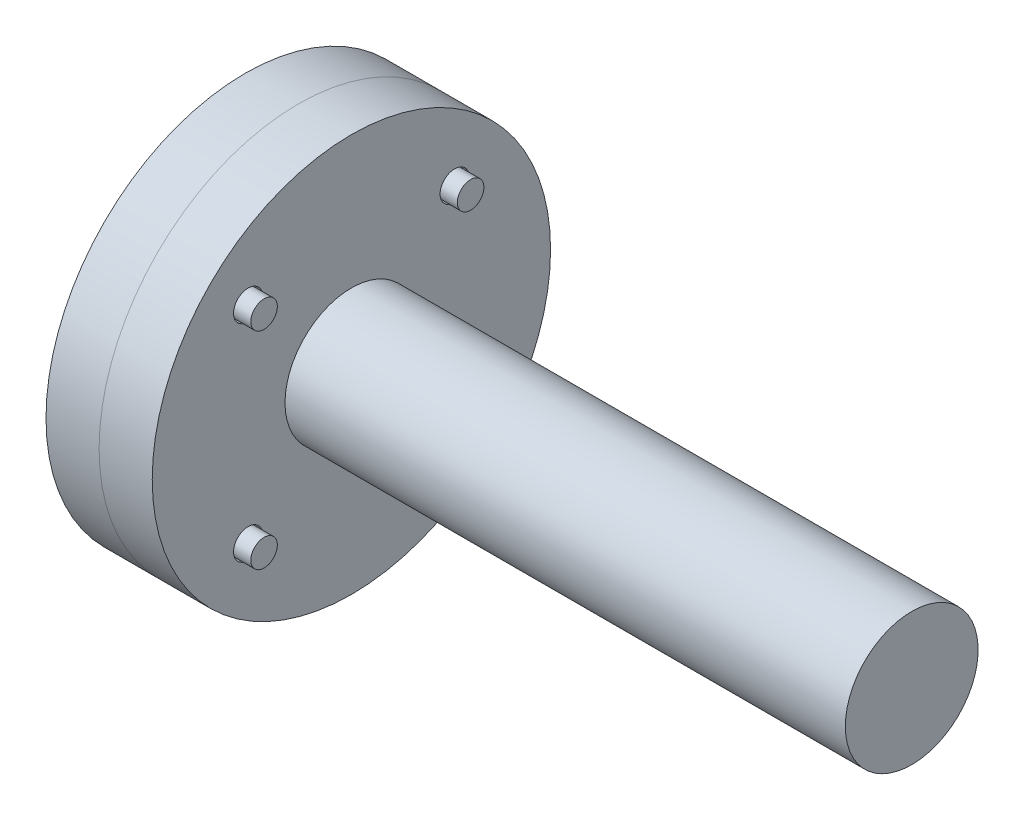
ISO-10303-21;
HEADER;
FILE_DESCRIPTION(('STEP AP214'),'2;1');
FILE_NAME('part.step','',(''),(''),'','','');
FILE_SCHEMA(('AUTOMOTIVE_DESIGN { 1 0 10303 214 1 1 1 1 }'));
ENDSEC;
DATA;
#1=APPLICATION_CONTEXT('core data for automotive mechanical design processes');
#2=APPLICATION_PROTOCOL_DEFINITION('international standard','automotive_design',2000,#1);
#3=PRODUCT_CONTEXT('',#1,'mechanical');
#4=PRODUCT('Part','Part','',(#3));
#5=PRODUCT_RELATED_PRODUCT_CATEGORY('part','',(#4));
#6=PRODUCT_DEFINITION_FORMATION('','',#4);
#7=PRODUCT_DEFINITION_CONTEXT('part definition',#1,'design');
#8=PRODUCT_DEFINITION('design','',#6,#7);
#9=PRODUCT_DEFINITION_SHAPE('','',#8);
#10=(LENGTH_UNIT() NAMED_UNIT(*) SI_UNIT(.MILLI.,.METRE.));
#11=(NAMED_UNIT(*) PLANE_ANGLE_UNIT() SI_UNIT($,.RADIAN.));
#12=(NAMED_UNIT(*) SI_UNIT($,.STERADIAN.) SOLID_ANGLE_UNIT());
#13=UNCERTAINTY_MEASURE_WITH_UNIT(LENGTH_MEASURE(1.E-05),#10,'distance_accuracy_value','');
#14=(GEOMETRIC_REPRESENTATION_CONTEXT(3) GLOBAL_UNCERTAINTY_ASSIGNED_CONTEXT((#13)) GLOBAL_UNIT_ASSIGNED_CONTEXT((#10,
#11,#12)) REPRESENTATION_CONTEXT('',''));
#15=CARTESIAN_POINT('',(0.,0.,0.));
#16=DIRECTION('',(0.,0.,1.));
#17=DIRECTION('',(1.,0.,0.));
#18=AXIS2_PLACEMENT_3D('',#15,#16,#17);
#19=CARTESIAN_POINT('',(930.,177.78174593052,1177.781745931));
#20=DIRECTION('',(1.,0.,0.));
#21=DIRECTION('',(0.,1.,0.));
#22=AXIS2_PLACEMENT_3D('',#19,#20,#21);
#23=PLANE('',#22);
#24=CARTESIAN_POINT('',(930.,177.78174593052,1177.781745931));
#25=DIRECTION('',(1.,0.,0.));
#26=DIRECTION('',(0.,0.,1.));
#27=AXIS2_PLACEMENT_3D('',#24,#25,#26);
#28=CIRCLE('',#27,16.);
#29=CARTESIAN_POINT('',(930.,177.78174593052,1193.781745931));
#30=VERTEX_POINT('',#29);
#31=EDGE_CURVE('P0_E10',#30,#30,#28,.T.);
#32=ORIENTED_EDGE('',*,*,#31,.F.);
#33=EDGE_LOOP('',(#32));
#34=FACE_BOUND('',#33,.T.);
#35=ADVANCED_FACE('P0_F15',(#34),#23,.F.);
#36=CARTESIAN_POINT('',(930.,177.78174593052,1177.781745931));
#37=DIRECTION('',(1.,0.,0.));
#38=DIRECTION('',(0.,0.,1.));
#39=AXIS2_PLACEMENT_3D('',#36,#37,#38);
#40=CYLINDRICAL_SURFACE('',#39,16.);
#41=CARTESIAN_POINT('',(938.,177.78174593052,1177.781745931));
#42=DIRECTION('',(1.,0.,0.));
#43=DIRECTION('',(0.,0.,1.));
#44=AXIS2_PLACEMENT_3D('',#41,#42,#43);
#45=CIRCLE('',#44,16.);
#46=CARTESIAN_POINT('',(938.,177.78174593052,1193.781745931));
#47=VERTEX_POINT('',#46);
#48=EDGE_CURVE('P0_E23',#47,#47,#45,.T.);
#49=ORIENTED_EDGE('',*,*,#48,.F.);
#50=EDGE_LOOP('',(#49));
#51=FACE_BOUND('',#50,.T.);
#52=ORIENTED_EDGE('',*,*,#31,.T.);
#53=EDGE_LOOP('',(#52));
#54=FACE_BOUND('',#53,.T.);
#55=ADVANCED_FACE('P0_F17',(#51,#54),#40,.T.);
#56=CARTESIAN_POINT('',(1030.,177.78174593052,1177.781745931));
#57=DIRECTION('',(1.,0.,0.));
#58=DIRECTION('',(0.,1.,0.));
#59=AXIS2_PLACEMENT_3D('',#56,#57,#58);
#60=PLANE('',#59);
#61=CARTESIAN_POINT('',(1030.,177.78174593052,1177.781745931));
#62=DIRECTION('',(1.,0.,0.));
#63=DIRECTION('',(0.,0.,1.));
#64=AXIS2_PLACEMENT_3D('',#61,#62,#63);
#65=CIRCLE('',#64,10.);
#66=CARTESIAN_POINT('',(1030.,177.78174593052,1187.781745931));
#67=VERTEX_POINT('',#66);
#68=EDGE_CURVE('P0_E40',#67,#67,#65,.T.);
#69=ORIENTED_EDGE('',*,*,#68,.T.);
#70=EDGE_LOOP('',(#69));
#71=FACE_BOUND('',#70,.T.);
#72=ADVANCED_FACE('P0_F44',(#71),#60,.T.);
#73=CARTESIAN_POINT('',(938.,177.78174593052,1177.781745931));
#74=DIRECTION('',(1.,0.,0.));
#75=DIRECTION('',(0.,1.,0.));
#76=AXIS2_PLACEMENT_3D('',#73,#74,#75);
#77=PLANE('',#76);
#78=CARTESIAN_POINT('',(938.,177.78174593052,1177.781745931));
#79=DIRECTION('',(1.,0.,0.));
#80=DIRECTION('',(0.,0.,1.));
#81=AXIS2_PLACEMENT_3D('',#78,#79,#80);
#82=CIRCLE('',#81,10.);
#83=CARTESIAN_POINT('',(938.,177.78174593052,1187.781745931));
#84=VERTEX_POINT('',#83);
#85=EDGE_CURVE('P0_E33',#84,#84,#82,.T.);
#86=ORIENTED_EDGE('',*,*,#85,.F.);
#87=EDGE_LOOP('',(#86));
#88=FACE_BOUND('',#87,.T.);
#89=ORIENTED_EDGE('',*,*,#48,.T.);
#90=EDGE_LOOP('',(#89));
#91=FACE_BOUND('',#90,.T.);
#92=ADVANCED_FACE('P0_F49',(#88,#91),#77,.T.);
#93=CARTESIAN_POINT('',(931.,177.78174593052,1177.781745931));
#94=DIRECTION('',(1.,0.,0.));
#95=DIRECTION('',(0.,0.,1.));
#96=AXIS2_PLACEMENT_3D('',#93,#94,#95);
#97=CYLINDRICAL_SURFACE('',#96,10.);
#98=ORIENTED_EDGE('',*,*,#68,.F.);
#99=EDGE_LOOP('',(#98));
#100=FACE_BOUND('',#99,.T.);
#101=ORIENTED_EDGE('',*,*,#85,.T.);
#102=EDGE_LOOP('',(#101));
#103=FACE_BOUND('',#102,.T.);
#104=ADVANCED_FACE('P0_F50',(#100,#103),#97,.T.);
#105=CLOSED_SHELL('',(#35,#55,#72,#92,#104));
#106=MANIFOLD_SOLID_BREP('P0_B1',#105);
#107=CARTESIAN_POINT('',(930.,22.21825406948,1177.781745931));
#108=DIRECTION('',(1.,0.,0.));
#109=DIRECTION('',(0.,1.,0.));
#110=AXIS2_PLACEMENT_3D('',#107,#108,#109);
#111=PLANE('',#110);
#112=CARTESIAN_POINT('',(930.,22.21825406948,1177.781745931));
#113=DIRECTION('',(1.,0.,0.));
#114=DIRECTION('',(0.,0.,1.));
#115=AXIS2_PLACEMENT_3D('',#112,#113,#114);
#116=CIRCLE('',#115,16.);
#117=CARTESIAN_POINT('',(930.,22.21825406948,1193.781745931));
#118=VERTEX_POINT('',#117);
#119=EDGE_CURVE('P1_E10',#118,#118,#116,.T.);
#120=ORIENTED_EDGE('',*,*,#119,.F.);
#121=EDGE_LOOP('',(#120));
#122=FACE_BOUND('',#121,.T.);
#123=ADVANCED_FACE('P1_F15',(#122),#111,.F.);
#124=CARTESIAN_POINT('',(930.,22.21825406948,1177.781745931));
#125=DIRECTION('',(1.,0.,0.));
#126=DIRECTION('',(0.,0.,1.));
#127=AXIS2_PLACEMENT_3D('',#124,#125,#126);
#128=CYLINDRICAL_SURFACE('',#127,16.);
#129=CARTESIAN_POINT('',(938.,22.21825406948,1177.781745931));
#130=DIRECTION('',(1.,0.,0.));
#131=DIRECTION('',(0.,0.,1.));
#132=AXIS2_PLACEMENT_3D('',#129,#130,#131);
#133=CIRCLE('',#132,16.);
#134=CARTESIAN_POINT('',(938.,22.21825406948,1193.781745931));
#135=VERTEX_POINT('',#134);
#136=EDGE_CURVE('P1_E22',#135,#135,#133,.T.);
#137=ORIENTED_EDGE('',*,*,#136,.F.);
#138=EDGE_LOOP('',(#137));
#139=FACE_BOUND('',#138,.T.);
#140=ORIENTED_EDGE('',*,*,#119,.T.);
#141=EDGE_LOOP('',(#140));
#142=FACE_BOUND('',#141,.T.);
#143=ADVANCED_FACE('P1_F56',(#139,#142),#128,.T.);
#144=CARTESIAN_POINT('',(1030.,22.21825406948,1177.781745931));
#145=DIRECTION('',(1.,0.,0.));
#146=DIRECTION('',(0.,1.,0.));
#147=AXIS2_PLACEMENT_3D('',#144,#145,#146);
#148=PLANE('',#147);
#149=CARTESIAN_POINT('',(1030.,22.21825406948,1177.781745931));
#150=DIRECTION('',(1.,0.,0.));
#151=DIRECTION('',(0.,0.,1.));
#152=AXIS2_PLACEMENT_3D('',#149,#150,#151);
#153=CIRCLE('',#152,10.);
#154=CARTESIAN_POINT('',(1030.,22.21825406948,1187.781745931));
#155=VERTEX_POINT('',#154);
#156=EDGE_CURVE('P1_E38',#155,#155,#153,.T.);
#157=ORIENTED_EDGE('',*,*,#156,.T.);
#158=EDGE_LOOP('',(#157));
#159=FACE_BOUND('',#158,.T.);
#160=ADVANCED_FACE('P1_F42',(#159),#148,.T.);
#161=CARTESIAN_POINT('',(938.,22.21825406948,1177.781745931));
#162=DIRECTION('',(1.,0.,0.));
#163=DIRECTION('',(0.,1.,0.));
#164=AXIS2_PLACEMENT_3D('',#161,#162,#163);
#165=PLANE('',#164);
#166=CARTESIAN_POINT('',(938.,22.21825406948,1177.781745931));
#167=DIRECTION('',(1.,0.,0.));
#168=DIRECTION('',(0.,0.,1.));
#169=AXIS2_PLACEMENT_3D('',#166,#167,#168);
#170=CIRCLE('',#169,10.);
#171=CARTESIAN_POINT('',(938.,22.21825406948,1187.781745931));
#172=VERTEX_POINT('',#171);
#173=EDGE_CURVE('P1_E28',#172,#172,#170,.T.);
#174=ORIENTED_EDGE('',*,*,#173,.F.);
#175=EDGE_LOOP('',(#174));
#176=FACE_BOUND('',#175,.T.);
#177=ORIENTED_EDGE('',*,*,#136,.T.);
#178=EDGE_LOOP('',(#177));
#179=FACE_BOUND('',#178,.T.);
#180=ADVANCED_FACE('P1_F47',(#176,#179),#165,.T.);
#181=CARTESIAN_POINT('',(931.,22.21825406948,1177.781745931));
#182=DIRECTION('',(1.,0.,0.));
#183=DIRECTION('',(0.,0.,1.));
#184=AXIS2_PLACEMENT_3D('',#181,#182,#183);
#185=CYLINDRICAL_SURFACE('',#184,10.);
#186=ORIENTED_EDGE('',*,*,#156,.F.);
#187=EDGE_LOOP('',(#186));
#188=FACE_BOUND('',#187,.T.);
#189=ORIENTED_EDGE('',*,*,#173,.T.);
#190=EDGE_LOOP('',(#189));
#191=FACE_BOUND('',#190,.T.);
#192=ADVANCED_FACE('P1_F46',(#188,#191),#185,.T.);
#193=CLOSED_SHELL('',(#123,#143,#160,#180,#192));
#194=MANIFOLD_SOLID_BREP('P1_B1',#193);
#195=CARTESIAN_POINT('',(930.,22.21825406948,1022.218254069));
#196=DIRECTION('',(1.,0.,0.));
#197=DIRECTION('',(0.,1.,0.));
#198=AXIS2_PLACEMENT_3D('',#195,#196,#197);
#199=PLANE('',#198);
#200=CARTESIAN_POINT('',(930.,22.21825406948,1022.218254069));
#201=DIRECTION('',(1.,0.,0.));
#202=DIRECTION('',(0.,0.,1.));
#203=AXIS2_PLACEMENT_3D('',#200,#201,#202);
#204=CIRCLE('',#203,16.);
#205=CARTESIAN_POINT('',(930.,22.21825406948,1038.218254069));
#206=VERTEX_POINT('',#205);
#207=EDGE_CURVE('P2_E10',#206,#206,#204,.T.);
#208=ORIENTED_EDGE('',*,*,#207,.F.);
#209=EDGE_LOOP('',(#208));
#210=FACE_BOUND('',#209,.T.);
#211=ADVANCED_FACE('P2_F15',(#210),#199,.F.);
#212=CARTESIAN_POINT('',(930.,22.21825406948,1022.218254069));
#213=DIRECTION('',(1.,0.,0.));
#214=DIRECTION('',(0.,0.,1.));
#215=AXIS2_PLACEMENT_3D('',#212,#213,#214);
#216=CYLINDRICAL_SURFACE('',#215,16.);
#217=CARTESIAN_POINT('',(938.,22.21825406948,1022.218254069));
#218=DIRECTION('',(1.,0.,0.));
#219=DIRECTION('',(0.,0.,1.));
#220=AXIS2_PLACEMENT_3D('',#217,#218,#219);
#221=CIRCLE('',#220,16.);
#222=CARTESIAN_POINT('',(938.,22.21825406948,1038.218254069));
#223=VERTEX_POINT('',#222);
#224=EDGE_CURVE('P2_E22',#223,#223,#221,.T.);
#225=ORIENTED_EDGE('',*,*,#224,.F.);
#226=EDGE_LOOP('',(#225));
#227=FACE_BOUND('',#226,.T.);
#228=ORIENTED_EDGE('',*,*,#207,.T.);
#229=EDGE_LOOP('',(#228));
#230=FACE_BOUND('',#229,.T.);
#231=ADVANCED_FACE('P2_F56',(#227,#230),#216,.T.);
#232=CARTESIAN_POINT('',(1030.,22.21825406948,1022.218254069));
#233=DIRECTION('',(1.,0.,0.));
#234=DIRECTION('',(0.,1.,0.));
#235=AXIS2_PLACEMENT_3D('',#232,#233,#234);
#236=PLANE('',#235);
#237=CARTESIAN_POINT('',(1030.,22.21825406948,1022.218254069));
#238=DIRECTION('',(1.,0.,0.));
#239=DIRECTION('',(0.,0.,1.));
#240=AXIS2_PLACEMENT_3D('',#237,#238,#239);
#241=CIRCLE('',#240,10.);
#242=CARTESIAN_POINT('',(1030.,22.21825406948,1032.218254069));
#243=VERTEX_POINT('',#242);
#244=EDGE_CURVE('P2_E38',#243,#243,#241,.T.);
#245=ORIENTED_EDGE('',*,*,#244,.T.);
#246=EDGE_LOOP('',(#245));
#247=FACE_BOUND('',#246,.T.);
#248=ADVANCED_FACE('P2_F42',(#247),#236,.T.);
#249=CARTESIAN_POINT('',(938.,22.21825406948,1022.218254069));
#250=DIRECTION('',(1.,0.,0.));
#251=DIRECTION('',(0.,1.,0.));
#252=AXIS2_PLACEMENT_3D('',#249,#250,#251);
#253=PLANE('',#252);
#254=CARTESIAN_POINT('',(938.,22.21825406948,1022.218254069));
#255=DIRECTION('',(1.,0.,0.));
#256=DIRECTION('',(0.,0.,1.));
#257=AXIS2_PLACEMENT_3D('',#254,#255,#256);
#258=CIRCLE('',#257,10.);
#259=CARTESIAN_POINT('',(938.,22.21825406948,1032.218254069));
#260=VERTEX_POINT('',#259);
#261=EDGE_CURVE('P2_E28',#260,#260,#258,.T.);
#262=ORIENTED_EDGE('',*,*,#261,.F.);
#263=EDGE_LOOP('',(#262));
#264=FACE_BOUND('',#263,.T.);
#265=ORIENTED_EDGE('',*,*,#224,.T.);
#266=EDGE_LOOP('',(#265));
#267=FACE_BOUND('',#266,.T.);
#268=ADVANCED_FACE('P2_F47',(#264,#267),#253,.T.);
#269=CARTESIAN_POINT('',(931.,22.21825406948,1022.218254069));
#270=DIRECTION('',(1.,0.,0.));
#271=DIRECTION('',(0.,0.,1.));
#272=AXIS2_PLACEMENT_3D('',#269,#270,#271);
#273=CYLINDRICAL_SURFACE('',#272,10.);
#274=ORIENTED_EDGE('',*,*,#244,.F.);
#275=EDGE_LOOP('',(#274));
#276=FACE_BOUND('',#275,.T.);
#277=ORIENTED_EDGE('',*,*,#261,.T.);
#278=EDGE_LOOP('',(#277));
#279=FACE_BOUND('',#278,.T.);
#280=ADVANCED_FACE('P2_F46',(#276,#279),#273,.T.);
#281=CLOSED_SHELL('',(#211,#231,#248,#268,#280));
#282=MANIFOLD_SOLID_BREP('P2_B1',#281);
#283=CARTESIAN_POINT('',(930.,177.78174593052,1022.218254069));
#284=DIRECTION('',(1.,0.,0.));
#285=DIRECTION('',(0.,1.,0.));
#286=AXIS2_PLACEMENT_3D('',#283,#284,#285);
#287=PLANE('',#286);
#288=CARTESIAN_POINT('',(930.,177.78174593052,1022.218254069));
#289=DIRECTION('',(1.,0.,0.));
#290=DIRECTION('',(0.,0.,1.));
#291=AXIS2_PLACEMENT_3D('',#288,#289,#290);
#292=CIRCLE('',#291,16.);
#293=CARTESIAN_POINT('',(930.,177.78174593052,1038.218254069));
#294=VERTEX_POINT('',#293);
#295=EDGE_CURVE('P3_E10',#294,#294,#292,.T.);
#296=ORIENTED_EDGE('',*,*,#295,.F.);
#297=EDGE_LOOP('',(#296));
#298=FACE_BOUND('',#297,.T.);
#299=ADVANCED_FACE('P3_F15',(#298),#287,.F.);
#300=CARTESIAN_POINT('',(930.,177.78174593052,1022.218254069));
#301=DIRECTION('',(1.,0.,0.));
#302=DIRECTION('',(0.,0.,1.));
#303=AXIS2_PLACEMENT_3D('',#300,#301,#302);
#304=CYLINDRICAL_SURFACE('',#303,16.);
#305=CARTESIAN_POINT('',(938.,177.78174593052,1022.218254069));
#306=DIRECTION('',(1.,0.,0.));
#307=DIRECTION('',(0.,0.,1.));
#308=AXIS2_PLACEMENT_3D('',#305,#306,#307);
#309=CIRCLE('',#308,16.);
#310=CARTESIAN_POINT('',(938.,177.78174593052,1038.218254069));
#311=VERTEX_POINT('',#310);
#312=EDGE_CURVE('P3_E22',#311,#311,#309,.T.);
#313=ORIENTED_EDGE('',*,*,#312,.F.);
#314=EDGE_LOOP('',(#313));
#315=FACE_BOUND('',#314,.T.);
#316=ORIENTED_EDGE('',*,*,#295,.T.);
#317=EDGE_LOOP('',(#316));
#318=FACE_BOUND('',#317,.T.);
#319=ADVANCED_FACE('P3_F56',(#315,#318),#304,.T.);
#320=CARTESIAN_POINT('',(1030.,177.78174593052,1022.218254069));
#321=DIRECTION('',(1.,0.,0.));
#322=DIRECTION('',(0.,1.,0.));
#323=AXIS2_PLACEMENT_3D('',#320,#321,#322);
#324=PLANE('',#323);
#325=CARTESIAN_POINT('',(1030.,177.78174593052,1022.218254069));
#326=DIRECTION('',(1.,0.,0.));
#327=DIRECTION('',(0.,0.,1.));
#328=AXIS2_PLACEMENT_3D('',#325,#326,#327);
#329=CIRCLE('',#328,10.);
#330=CARTESIAN_POINT('',(1030.,177.78174593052,1032.218254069));
#331=VERTEX_POINT('',#330);
#332=EDGE_CURVE('P3_E38',#331,#331,#329,.T.);
#333=ORIENTED_EDGE('',*,*,#332,.T.);
#334=EDGE_LOOP('',(#333));
#335=FACE_BOUND('',#334,.T.);
#336=ADVANCED_FACE('P3_F42',(#335),#324,.T.);
#337=CARTESIAN_POINT('',(938.,177.78174593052,1022.218254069));
#338=DIRECTION('',(1.,0.,0.));
#339=DIRECTION('',(0.,1.,0.));
#340=AXIS2_PLACEMENT_3D('',#337,#338,#339);
#341=PLANE('',#340);
#342=CARTESIAN_POINT('',(938.,177.78174593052,1022.218254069));
#343=DIRECTION('',(1.,0.,0.));
#344=DIRECTION('',(0.,0.,1.));
#345=AXIS2_PLACEMENT_3D('',#342,#343,#344);
#346=CIRCLE('',#345,10.);
#347=CARTESIAN_POINT('',(938.,177.78174593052,1032.218254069));
#348=VERTEX_POINT('',#347);
#349=EDGE_CURVE('P3_E28',#348,#348,#346,.T.);
#350=ORIENTED_EDGE('',*,*,#349,.F.);
#351=EDGE_LOOP('',(#350));
#352=FACE_BOUND('',#351,.T.);
#353=ORIENTED_EDGE('',*,*,#312,.T.);
#354=EDGE_LOOP('',(#353));
#355=FACE_BOUND('',#354,.T.);
#356=ADVANCED_FACE('P3_F47',(#352,#355),#341,.T.);
#357=CARTESIAN_POINT('',(931.,177.78174593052,1022.218254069));
#358=DIRECTION('',(1.,0.,0.));
#359=DIRECTION('',(0.,0.,1.));
#360=AXIS2_PLACEMENT_3D('',#357,#358,#359);
#361=CYLINDRICAL_SURFACE('',#360,10.);
#362=ORIENTED_EDGE('',*,*,#332,.F.);
#363=EDGE_LOOP('',(#362));
#364=FACE_BOUND('',#363,.T.);
#365=ORIENTED_EDGE('',*,*,#349,.T.);
#366=EDGE_LOOP('',(#365));
#367=FACE_BOUND('',#366,.T.);
#368=ADVANCED_FACE('P3_F46',(#364,#367),#361,.T.);
#369=CLOSED_SHELL('',(#299,#319,#336,#356,#368));
#370=MANIFOLD_SOLID_BREP('P3_B1',#369);
#371=CARTESIAN_POINT('',(936.,22.21825406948,1177.781745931));
#372=DIRECTION('',(1.,0.,0.));
#373=DIRECTION('',(0.,0.,1.));
#374=AXIS2_PLACEMENT_3D('',#371,#372,#373);
#375=CYLINDRICAL_SURFACE('',#374,11.);
#376=CARTESIAN_POINT('',(978.,22.21825406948,1177.781745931));
#377=DIRECTION('',(1.,0.,0.));
#378=DIRECTION('',(0.,0.,1.));
#379=AXIS2_PLACEMENT_3D('',#376,#377,#378);
#380=CIRCLE('',#379,11.);
#381=CARTESIAN_POINT('',(978.,22.21825406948,1188.781745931));
#382=VERTEX_POINT('',#381);
#383=EDGE_CURVE('P4_E43',#382,#382,#380,.T.);
#384=ORIENTED_EDGE('',*,*,#383,.T.);
#385=EDGE_LOOP('',(#384));
#386=FACE_BOUND('',#385,.T.);
#387=CARTESIAN_POINT('',(938.,22.21825406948,1177.781745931));
#388=DIRECTION('',(1.,0.,0.));
#389=DIRECTION('',(0.,0.,1.));
#390=AXIS2_PLACEMENT_3D('',#387,#388,#389);
#391=CIRCLE('',#390,11.);
#392=CARTESIAN_POINT('',(938.,22.21825406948,1188.781745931));
#393=VERTEX_POINT('',#392);
#394=EDGE_CURVE('P4_E10',#393,#393,#391,.T.);
#395=ORIENTED_EDGE('',*,*,#394,.F.);
#396=EDGE_LOOP('',(#395));
#397=FACE_BOUND('',#396,.T.);
#398=ADVANCED_FACE('P4_F15',(#386,#397),#375,.F.);
#399=CARTESIAN_POINT('',(936.,50.,1100.));
#400=DIRECTION('',(1.,0.,0.));
#401=DIRECTION('',(0.,0.,1.));
#402=AXIS2_PLACEMENT_3D('',#399,#400,#401);
#403=CYLINDRICAL_SURFACE('',#402,30.);
#404=CARTESIAN_POINT('',(978.,50.,1100.));
#405=DIRECTION('',(1.,0.,0.));
#406=DIRECTION('',(0.,0.,1.));
#407=AXIS2_PLACEMENT_3D('',#404,#405,#406);
#408=CIRCLE('',#407,30.);
#409=CARTESIAN_POINT('',(978.,50.,1130.));
#410=VERTEX_POINT('',#409);
#411=EDGE_CURVE('P4_E50',#410,#410,#408,.T.);
#412=ORIENTED_EDGE('',*,*,#411,.T.);
#413=EDGE_LOOP('',(#412));
#414=FACE_BOUND('',#413,.T.);
#415=CARTESIAN_POINT('',(938.,50.,1100.));
#416=DIRECTION('',(1.,0.,0.));
#417=DIRECTION('',(0.,0.,1.));
#418=AXIS2_PLACEMENT_3D('',#415,#416,#417);
#419=CIRCLE('',#418,30.);
#420=CARTESIAN_POINT('',(938.,50.,1130.));
#421=VERTEX_POINT('',#420);
#422=EDGE_CURVE('P4_E22',#421,#421,#419,.T.);
#423=ORIENTED_EDGE('',*,*,#422,.F.);
#424=EDGE_LOOP('',(#423));
#425=FACE_BOUND('',#424,.T.);
#426=ADVANCED_FACE('P4_F97',(#414,#425),#403,.F.);
#427=CARTESIAN_POINT('',(936.,22.21825406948,1022.218254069));
#428=DIRECTION('',(1.,0.,0.));
#429=DIRECTION('',(0.,0.,1.));
#430=AXIS2_PLACEMENT_3D('',#427,#428,#429);
#431=CYLINDRICAL_SURFACE('',#430,11.);
#432=CARTESIAN_POINT('',(978.,22.21825406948,1022.218254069));
#433=DIRECTION('',(1.,0.,0.));
#434=DIRECTION('',(0.,0.,1.));
#435=AXIS2_PLACEMENT_3D('',#432,#433,#434);
#436=CIRCLE('',#435,11.);
#437=CARTESIAN_POINT('',(978.,22.21825406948,1033.218254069));
#438=VERTEX_POINT('',#437);
#439=EDGE_CURVE('P4_E53',#438,#438,#436,.T.);
#440=ORIENTED_EDGE('',*,*,#439,.T.);
#441=EDGE_LOOP('',(#440));
#442=FACE_BOUND('',#441,.T.);
#443=CARTESIAN_POINT('',(938.,22.21825406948,1022.218254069));
#444=DIRECTION('',(1.,0.,0.));
#445=DIRECTION('',(0.,0.,1.));
#446=AXIS2_PLACEMENT_3D('',#443,#444,#445);
#447=CIRCLE('',#446,11.);
#448=CARTESIAN_POINT('',(938.,22.21825406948,1033.218254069));
#449=VERTEX_POINT('',#448);
#450=EDGE_CURVE('P4_E28',#449,#449,#447,.T.);
#451=ORIENTED_EDGE('',*,*,#450,.F.);
#452=EDGE_LOOP('',(#451));
#453=FACE_BOUND('',#452,.T.);
#454=ADVANCED_FACE('P4_F102',(#442,#453),#431,.F.);
#455=CARTESIAN_POINT('',(936.,177.78174593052,1177.781745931));
#456=DIRECTION('',(1.,0.,0.));
#457=DIRECTION('',(0.,0.,1.));
#458=AXIS2_PLACEMENT_3D('',#455,#456,#457);
#459=CYLINDRICAL_SURFACE('',#458,11.);
#460=CARTESIAN_POINT('',(978.,177.78174593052,1177.781745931));
#461=DIRECTION('',(1.,0.,0.));
#462=DIRECTION('',(0.,0.,1.));
#463=AXIS2_PLACEMENT_3D('',#460,#461,#462);
#464=CIRCLE('',#463,11.);
#465=CARTESIAN_POINT('',(978.,177.78174593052,1188.781745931));
#466=VERTEX_POINT('',#465);
#467=EDGE_CURVE('P4_E59',#466,#466,#464,.T.);
#468=ORIENTED_EDGE('',*,*,#467,.T.);
#469=EDGE_LOOP('',(#468));
#470=FACE_BOUND('',#469,.T.);
#471=CARTESIAN_POINT('',(938.,177.78174593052,1177.781745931));
#472=DIRECTION('',(1.,0.,0.));
#473=DIRECTION('',(0.,0.,1.));
#474=AXIS2_PLACEMENT_3D('',#471,#472,#473);
#475=CIRCLE('',#474,11.);
#476=CARTESIAN_POINT('',(938.,177.78174593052,1188.781745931));
#477=VERTEX_POINT('',#476);
#478=EDGE_CURVE('P4_E38',#477,#477,#475,.T.);
#479=ORIENTED_EDGE('',*,*,#478,.F.);
#480=EDGE_LOOP('',(#479));
#481=FACE_BOUND('',#480,.T.);
#482=ADVANCED_FACE('P4_F92',(#470,#481),#459,.F.);
#483=CARTESIAN_POINT('',(936.,177.78174593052,1022.218254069));
#484=DIRECTION('',(1.,0.,0.));
#485=DIRECTION('',(0.,0.,1.));
#486=AXIS2_PLACEMENT_3D('',#483,#484,#485);
#487=CYLINDRICAL_SURFACE('',#486,11.);
#488=CARTESIAN_POINT('',(978.,177.78174593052,1022.218254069));
#489=DIRECTION('',(1.,0.,0.));
#490=DIRECTION('',(0.,0.,1.));
#491=AXIS2_PLACEMENT_3D('',#488,#489,#490);
#492=CIRCLE('',#491,11.);
#493=CARTESIAN_POINT('',(978.,177.78174593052,1033.218254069));
#494=VERTEX_POINT('',#493);
#495=EDGE_CURVE('P4_E62',#494,#494,#492,.T.);
#496=ORIENTED_EDGE('',*,*,#495,.T.);
#497=EDGE_LOOP('',(#496));
#498=FACE_BOUND('',#497,.T.);
#499=CARTESIAN_POINT('',(938.,177.78174593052,1022.218254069));
#500=DIRECTION('',(1.,0.,0.));
#501=DIRECTION('',(0.,0.,1.));
#502=AXIS2_PLACEMENT_3D('',#499,#500,#501);
#503=CIRCLE('',#502,11.);
#504=CARTESIAN_POINT('',(938.,177.78174593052,1033.218254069));
#505=VERTEX_POINT('',#504);
#506=EDGE_CURVE('P4_E39',#505,#505,#503,.T.);
#507=ORIENTED_EDGE('',*,*,#506,.F.);
#508=EDGE_LOOP('',(#507));
#509=FACE_BOUND('',#508,.T.);
#510=ADVANCED_FACE('P4_F88',(#498,#509),#487,.F.);
#511=CARTESIAN_POINT('',(938.,100.,1100.));
#512=DIRECTION('',(1.,0.,0.));
#513=DIRECTION('',(0.,1.,0.));
#514=AXIS2_PLACEMENT_3D('',#511,#512,#513);
#515=PLANE('',#514);
#516=ORIENTED_EDGE('',*,*,#394,.T.);
#517=EDGE_LOOP('',(#516));
#518=FACE_BOUND('',#517,.T.);
#519=ORIENTED_EDGE('',*,*,#422,.T.);
#520=EDGE_LOOP('',(#519));
#521=FACE_BOUND('',#520,.T.);
#522=ORIENTED_EDGE('',*,*,#450,.T.);
#523=EDGE_LOOP('',(#522));
#524=FACE_BOUND('',#523,.T.);
#525=ORIENTED_EDGE('',*,*,#478,.T.);
#526=EDGE_LOOP('',(#525));
#527=FACE_BOUND('',#526,.T.);
#528=ORIENTED_EDGE('',*,*,#506,.T.);
#529=EDGE_LOOP('',(#528));
#530=FACE_BOUND('',#529,.T.);
#531=CARTESIAN_POINT('',(938.,100.,1100.));
#532=DIRECTION('',(1.,0.,0.));
#533=DIRECTION('',(0.,0.,1.));
#534=AXIS2_PLACEMENT_3D('',#531,#532,#533);
#535=CIRCLE('',#534,150.);
#536=CARTESIAN_POINT('',(938.,100.,1250.));
#537=VERTEX_POINT('',#536);
#538=EDGE_CURVE('P4_E67',#537,#537,#535,.T.);
#539=ORIENTED_EDGE('',*,*,#538,.F.);
#540=EDGE_LOOP('',(#539));
#541=FACE_BOUND('',#540,.T.);
#542=ADVANCED_FACE('P4_F81',(#518,#521,#524,#527,#530,#541),#515,.F.);
#543=CARTESIAN_POINT('',(978.,100.,1100.));
#544=DIRECTION('',(1.,0.,0.));
#545=DIRECTION('',(0.,1.,0.));
#546=AXIS2_PLACEMENT_3D('',#543,#544,#545);
#547=PLANE('',#546);
#548=ORIENTED_EDGE('',*,*,#383,.F.);
#549=EDGE_LOOP('',(#548));
#550=FACE_BOUND('',#549,.T.);
#551=ORIENTED_EDGE('',*,*,#411,.F.);
#552=EDGE_LOOP('',(#551));
#553=FACE_BOUND('',#552,.T.);
#554=ORIENTED_EDGE('',*,*,#439,.F.);
#555=EDGE_LOOP('',(#554));
#556=FACE_BOUND('',#555,.T.);
#557=ORIENTED_EDGE('',*,*,#467,.F.);
#558=EDGE_LOOP('',(#557));
#559=FACE_BOUND('',#558,.T.);
#560=ORIENTED_EDGE('',*,*,#495,.F.);
#561=EDGE_LOOP('',(#560));
#562=FACE_BOUND('',#561,.T.);
#563=CARTESIAN_POINT('',(978.,100.,1100.));
#564=DIRECTION('',(1.,0.,0.));
#565=DIRECTION('',(0.,0.,1.));
#566=AXIS2_PLACEMENT_3D('',#563,#564,#565);
#567=CIRCLE('',#566,150.);
#568=CARTESIAN_POINT('',(978.,100.,1250.));
#569=VERTEX_POINT('',#568);
#570=EDGE_CURVE('P4_E68',#569,#569,#567,.T.);
#571=ORIENTED_EDGE('',*,*,#570,.T.);
#572=EDGE_LOOP('',(#571));
#573=FACE_BOUND('',#572,.T.);
#574=ADVANCED_FACE('P4_F76',(#550,#553,#556,#559,#562,#573),#547,.T.);
#575=CARTESIAN_POINT('',(938.,100.,1100.));
#576=DIRECTION('',(1.,0.,0.));
#577=DIRECTION('',(0.,0.,1.));
#578=AXIS2_PLACEMENT_3D('',#575,#576,#577);
#579=CYLINDRICAL_SURFACE('',#578,150.);
#580=ORIENTED_EDGE('',*,*,#570,.F.);
#581=EDGE_LOOP('',(#580));
#582=FACE_BOUND('',#581,.T.);
#583=ORIENTED_EDGE('',*,*,#538,.T.);
#584=EDGE_LOOP('',(#583));
#585=FACE_BOUND('',#584,.T.);
#586=ADVANCED_FACE('P4_F77',(#582,#585),#579,.T.);
#587=CLOSED_SHELL('',(#398,#426,#454,#482,#510,#542,#574,#586));
#588=MANIFOLD_SOLID_BREP('P4_B1',#587);
#589=CARTESIAN_POINT('',(997.,50.,1100.));
#590=DIRECTION('',(1.,0.,0.));
#591=DIRECTION('',(0.,1.,0.));
#592=AXIS2_PLACEMENT_3D('',#589,#590,#591);
#593=PLANE('',#592);
#594=CARTESIAN_POINT('',(997.,50.,1100.));
#595=DIRECTION('',(1.,0.,0.));
#596=DIRECTION('',(0.,0.,1.));
#597=AXIS2_PLACEMENT_3D('',#594,#595,#596);
#598=CIRCLE('',#597,38.);
#599=CARTESIAN_POINT('',(997.,50.,1138.));
#600=VERTEX_POINT('',#599);
#601=EDGE_CURVE('P5_E10',#600,#600,#598,.T.);
#602=ORIENTED_EDGE('',*,*,#601,.F.);
#603=EDGE_LOOP('',(#602));
#604=FACE_BOUND('',#603,.T.);
#605=ADVANCED_FACE('P5_F15',(#604),#593,.F.);
#606=CARTESIAN_POINT('',(1440.,100.,1100.));
#607=DIRECTION('',(1.,0.,0.));
#608=DIRECTION('',(0.,1.,0.));
#609=AXIS2_PLACEMENT_3D('',#606,#607,#608);
#610=PLANE('',#609);
#611=CARTESIAN_POINT('',(1440.,100.,1100.));
#612=DIRECTION('',(1.,0.,0.));
#613=DIRECTION('',(0.,0.,1.));
#614=AXIS2_PLACEMENT_3D('',#611,#612,#613);
#615=CIRCLE('',#614,50.);
#616=CARTESIAN_POINT('',(1440.,100.,1150.));
#617=VERTEX_POINT('',#616);
#618=EDGE_CURVE('P5_E22',#617,#617,#615,.T.);
#619=ORIENTED_EDGE('',*,*,#618,.T.);
#620=EDGE_LOOP('',(#619));
#621=FACE_BOUND('',#620,.T.);
#622=ADVANCED_FACE('P5_F112',(#621),#610,.T.);
#623=CARTESIAN_POINT('',(977.,50.,1100.));
#624=DIRECTION('',(1.,0.,0.));
#625=DIRECTION('',(0.,0.,1.));
#626=AXIS2_PLACEMENT_3D('',#623,#624,#625);
#627=CYLINDRICAL_SURFACE('',#626,38.);
#628=ORIENTED_EDGE('',*,*,#601,.T.);
#629=EDGE_LOOP('',(#628));
#630=FACE_BOUND('',#629,.T.);
#631=CARTESIAN_POINT('',(978.,50.,1100.));
#632=DIRECTION('',(1.,0.,0.));
#633=DIRECTION('',(0.,0.,1.));
#634=AXIS2_PLACEMENT_3D('',#631,#632,#633);
#635=CIRCLE('',#634,38.);
#636=CARTESIAN_POINT('',(978.,50.,1138.));
#637=VERTEX_POINT('',#636);
#638=EDGE_CURVE('P5_E40',#637,#637,#635,.T.);
#639=ORIENTED_EDGE('',*,*,#638,.F.);
#640=EDGE_LOOP('',(#639));
#641=FACE_BOUND('',#640,.T.);
#642=ADVANCED_FACE('P5_F116',(#630,#641),#627,.F.);
#643=CARTESIAN_POINT('',(936.,22.21825406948,1177.781745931));
#644=DIRECTION('',(1.,0.,0.));
#645=DIRECTION('',(0.,0.,1.));
#646=AXIS2_PLACEMENT_3D('',#643,#644,#645);
#647=CYLINDRICAL_SURFACE('',#646,11.);
#648=CARTESIAN_POINT('',(1018.,22.21825406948,1177.781745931));
#649=DIRECTION('',(1.,0.,0.));
#650=DIRECTION('',(0.,0.,1.));
#651=AXIS2_PLACEMENT_3D('',#648,#649,#650);
#652=CIRCLE('',#651,11.);
#653=CARTESIAN_POINT('',(1018.,22.21825406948,1188.781745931));
#654=VERTEX_POINT('',#653);
#655=EDGE_CURVE('P5_E48',#654,#654,#652,.T.);
#656=ORIENTED_EDGE('',*,*,#655,.T.);
#657=EDGE_LOOP('',(#656));
#658=FACE_BOUND('',#657,.T.);
#659=CARTESIAN_POINT('',(978.,22.21825406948,1177.781745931));
#660=DIRECTION('',(1.,0.,0.));
#661=DIRECTION('',(0.,0.,1.));
#662=AXIS2_PLACEMENT_3D('',#659,#660,#661);
#663=CIRCLE('',#662,11.);
#664=CARTESIAN_POINT('',(978.,22.21825406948,1188.781745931));
#665=VERTEX_POINT('',#664);
#666=EDGE_CURVE('P5_E28',#665,#665,#663,.T.);
#667=ORIENTED_EDGE('',*,*,#666,.F.);
#668=EDGE_LOOP('',(#667));
#669=FACE_BOUND('',#668,.T.);
#670=ADVANCED_FACE('P5_F120',(#658,#669),#647,.F.);
#671=CARTESIAN_POINT('',(1018.,100.,1100.));
#672=DIRECTION('',(1.,0.,0.));
#673=DIRECTION('',(0.,0.,1.));
#674=AXIS2_PLACEMENT_3D('',#671,#672,#673);
#675=CYLINDRICAL_SURFACE('',#674,50.);
#676=ORIENTED_EDGE('',*,*,#618,.F.);
#677=EDGE_LOOP('',(#676));
#678=FACE_BOUND('',#677,.T.);
#679=CARTESIAN_POINT('',(1018.,100.,1100.));
#680=DIRECTION('',(1.,0.,0.));
#681=DIRECTION('',(0.,0.,1.));
#682=AXIS2_PLACEMENT_3D('',#679,#680,#681);
#683=CIRCLE('',#682,50.);
#684=CARTESIAN_POINT('',(1018.,100.,1150.));
#685=VERTEX_POINT('',#684);
#686=EDGE_CURVE('P5_E55',#685,#685,#683,.T.);
#687=ORIENTED_EDGE('',*,*,#686,.T.);
#688=EDGE_LOOP('',(#687));
#689=FACE_BOUND('',#688,.T.);
#690=ADVANCED_FACE('P5_F125',(#678,#689),#675,.T.);
#691=CARTESIAN_POINT('',(936.,22.21825406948,1022.218254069));
#692=DIRECTION('',(1.,0.,0.));
#693=DIRECTION('',(0.,0.,1.));
#694=AXIS2_PLACEMENT_3D('',#691,#692,#693);
#695=CYLINDRICAL_SURFACE('',#694,11.);
#696=CARTESIAN_POINT('',(1018.,22.21825406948,1022.218254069));
#697=DIRECTION('',(1.,0.,0.));
#698=DIRECTION('',(0.,0.,1.));
#699=AXIS2_PLACEMENT_3D('',#696,#697,#698);
#700=CIRCLE('',#699,11.);
#701=CARTESIAN_POINT('',(1018.,22.21825406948,1033.218254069));
#702=VERTEX_POINT('',#701);
#703=EDGE_CURVE('P5_E52',#702,#702,#700,.T.);
#704=ORIENTED_EDGE('',*,*,#703,.T.);
#705=EDGE_LOOP('',(#704));
#706=FACE_BOUND('',#705,.T.);
#707=CARTESIAN_POINT('',(978.,22.21825406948,1022.218254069));
#708=DIRECTION('',(1.,0.,0.));
#709=DIRECTION('',(0.,0.,1.));
#710=AXIS2_PLACEMENT_3D('',#707,#708,#709);
#711=CIRCLE('',#710,11.);
#712=CARTESIAN_POINT('',(978.,22.21825406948,1033.218254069));
#713=VERTEX_POINT('',#712);
#714=EDGE_CURVE('P5_E37',#713,#713,#711,.T.);
#715=ORIENTED_EDGE('',*,*,#714,.F.);
#716=EDGE_LOOP('',(#715));
#717=FACE_BOUND('',#716,.T.);
#718=ADVANCED_FACE('P5_F122',(#706,#717),#695,.F.);
#719=CARTESIAN_POINT('',(936.,177.78174593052,1177.781745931));
#720=DIRECTION('',(1.,0.,0.));
#721=DIRECTION('',(0.,0.,1.));
#722=AXIS2_PLACEMENT_3D('',#719,#720,#721);
#723=CYLINDRICAL_SURFACE('',#722,11.);
#724=CARTESIAN_POINT('',(1018.,177.78174593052,1177.781745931));
#725=DIRECTION('',(1.,0.,0.));
#726=DIRECTION('',(0.,0.,1.));
#727=AXIS2_PLACEMENT_3D('',#724,#725,#726);
#728=CIRCLE('',#727,11.);
#729=CARTESIAN_POINT('',(1018.,177.78174593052,1188.781745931));
#730=VERTEX_POINT('',#729);
#731=EDGE_CURVE('P5_E60',#730,#730,#728,.T.);
#732=ORIENTED_EDGE('',*,*,#731,.T.);
#733=EDGE_LOOP('',(#732));
#734=FACE_BOUND('',#733,.T.);
#735=CARTESIAN_POINT('',(978.,177.78174593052,1177.781745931));
#736=DIRECTION('',(1.,0.,0.));
#737=DIRECTION('',(0.,0.,1.));
#738=AXIS2_PLACEMENT_3D('',#735,#736,#737);
#739=CIRCLE('',#738,11.);
#740=CARTESIAN_POINT('',(978.,177.78174593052,1188.781745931));
#741=VERTEX_POINT('',#740);
#742=EDGE_CURVE('P5_E43',#741,#741,#739,.T.);
#743=ORIENTED_EDGE('',*,*,#742,.F.);
#744=EDGE_LOOP('',(#743));
#745=FACE_BOUND('',#744,.T.);
#746=ADVANCED_FACE('P5_F102',(#734,#745),#723,.F.);
#747=CARTESIAN_POINT('',(936.,177.78174593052,1022.218254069));
#748=DIRECTION('',(1.,0.,0.));
#749=DIRECTION('',(0.,0.,1.));
#750=AXIS2_PLACEMENT_3D('',#747,#748,#749);
#751=CYLINDRICAL_SURFACE('',#750,11.);
#752=CARTESIAN_POINT('',(1018.,177.78174593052,1022.218254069));
#753=DIRECTION('',(1.,0.,0.));
#754=DIRECTION('',(0.,0.,1.));
#755=AXIS2_PLACEMENT_3D('',#752,#753,#754);
#756=CIRCLE('',#755,11.);
#757=CARTESIAN_POINT('',(1018.,177.78174593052,1033.218254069));
#758=VERTEX_POINT('',#757);
#759=EDGE_CURVE('P5_E63',#758,#758,#756,.T.);
#760=ORIENTED_EDGE('',*,*,#759,.T.);
#761=EDGE_LOOP('',(#760));
#762=FACE_BOUND('',#761,.T.);
#763=CARTESIAN_POINT('',(978.,177.78174593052,1022.218254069));
#764=DIRECTION('',(1.,0.,0.));
#765=DIRECTION('',(0.,0.,1.));
#766=AXIS2_PLACEMENT_3D('',#763,#764,#765);
#767=CIRCLE('',#766,11.);
#768=CARTESIAN_POINT('',(978.,177.78174593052,1033.218254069));
#769=VERTEX_POINT('',#768);
#770=EDGE_CURVE('P5_E42',#769,#769,#767,.T.);
#771=ORIENTED_EDGE('',*,*,#770,.F.);
#772=EDGE_LOOP('',(#771));
#773=FACE_BOUND('',#772,.T.);
#774=ADVANCED_FACE('P5_F94',(#762,#773),#751,.F.);
#775=CARTESIAN_POINT('',(978.,100.,1100.));
#776=DIRECTION('',(1.,0.,0.));
#777=DIRECTION('',(0.,1.,0.));
#778=AXIS2_PLACEMENT_3D('',#775,#776,#777);
#779=PLANE('',#778);
#780=ORIENTED_EDGE('',*,*,#666,.T.);
#781=EDGE_LOOP('',(#780));
#782=FACE_BOUND('',#781,.T.);
#783=ORIENTED_EDGE('',*,*,#638,.T.);
#784=EDGE_LOOP('',(#783));
#785=FACE_BOUND('',#784,.T.);
#786=ORIENTED_EDGE('',*,*,#714,.T.);
#787=EDGE_LOOP('',(#786));
#788=FACE_BOUND('',#787,.T.);
#789=ORIENTED_EDGE('',*,*,#742,.T.);
#790=EDGE_LOOP('',(#789));
#791=FACE_BOUND('',#790,.T.);
#792=ORIENTED_EDGE('',*,*,#770,.T.);
#793=EDGE_LOOP('',(#792));
#794=FACE_BOUND('',#793,.T.);
#795=CARTESIAN_POINT('',(978.,100.,1100.));
#796=DIRECTION('',(1.,0.,0.));
#797=DIRECTION('',(0.,0.,1.));
#798=AXIS2_PLACEMENT_3D('',#795,#796,#797);
#799=CIRCLE('',#798,150.);
#800=CARTESIAN_POINT('',(978.,100.,1250.));
#801=VERTEX_POINT('',#800);
#802=EDGE_CURVE('P5_E75',#801,#801,#799,.T.);
#803=ORIENTED_EDGE('',*,*,#802,.F.);
#804=EDGE_LOOP('',(#803));
#805=FACE_BOUND('',#804,.T.);
#806=ADVANCED_FACE('P5_F95',(#782,#785,#788,#791,#794,#805),#779,.F.);
#807=CARTESIAN_POINT('',(1018.,100.,1100.));
#808=DIRECTION('',(1.,0.,0.));
#809=DIRECTION('',(0.,1.,0.));
#810=AXIS2_PLACEMENT_3D('',#807,#808,#809);
#811=PLANE('',#810);
#812=ORIENTED_EDGE('',*,*,#655,.F.);
#813=EDGE_LOOP('',(#812));
#814=FACE_BOUND('',#813,.T.);
#815=ORIENTED_EDGE('',*,*,#686,.F.);
#816=EDGE_LOOP('',(#815));
#817=FACE_BOUND('',#816,.T.);
#818=ORIENTED_EDGE('',*,*,#703,.F.);
#819=EDGE_LOOP('',(#818));
#820=FACE_BOUND('',#819,.T.);
#821=ORIENTED_EDGE('',*,*,#731,.F.);
#822=EDGE_LOOP('',(#821));
#823=FACE_BOUND('',#822,.T.);
#824=ORIENTED_EDGE('',*,*,#759,.F.);
#825=EDGE_LOOP('',(#824));
#826=FACE_BOUND('',#825,.T.);
#827=CARTESIAN_POINT('',(1018.,100.,1100.));
#828=DIRECTION('',(1.,0.,0.));
#829=DIRECTION('',(0.,0.,1.));
#830=AXIS2_PLACEMENT_3D('',#827,#828,#829);
#831=CIRCLE('',#830,150.);
#832=CARTESIAN_POINT('',(1018.,100.,1250.));
#833=VERTEX_POINT('',#832);
#834=EDGE_CURVE('P5_E74',#833,#833,#831,.T.);
#835=ORIENTED_EDGE('',*,*,#834,.T.);
#836=EDGE_LOOP('',(#835));
#837=FACE_BOUND('',#836,.T.);
#838=ADVANCED_FACE('P5_F81',(#814,#817,#820,#823,#826,#837),#811,.T.);
#839=CARTESIAN_POINT('',(978.,100.,1100.));
#840=DIRECTION('',(1.,0.,0.));
#841=DIRECTION('',(0.,0.,1.));
#842=AXIS2_PLACEMENT_3D('',#839,#840,#841);
#843=CYLINDRICAL_SURFACE('',#842,150.);
#844=ORIENTED_EDGE('',*,*,#834,.F.);
#845=EDGE_LOOP('',(#844));
#846=FACE_BOUND('',#845,.T.);
#847=ORIENTED_EDGE('',*,*,#802,.T.);
#848=EDGE_LOOP('',(#847));
#849=FACE_BOUND('',#848,.T.);
#850=ADVANCED_FACE('P5_F88',(#846,#849),#843,.T.);
#851=CLOSED_SHELL('',(#605,#622,#642,#670,#690,#718,#746,#774,#806,#838,#850));
#852=MANIFOLD_SOLID_BREP('P5_B1',#851);
#853=CARTESIAN_POINT('',(893.,50.,1100.));
#854=DIRECTION('',(1.,0.,0.));
#855=DIRECTION('',(0.,1.,0.));
#856=AXIS2_PLACEMENT_3D('',#853,#854,#855);
#857=PLANE('',#856);
#858=CARTESIAN_POINT('',(893.,50.,1100.));
#859=DIRECTION('',(1.,0.,0.));
#860=DIRECTION('',(0.,0.,1.));
#861=AXIS2_PLACEMENT_3D('',#858,#859,#860);
#862=CIRCLE('',#861,7.);
#863=CARTESIAN_POINT('',(893.,50.,1107.));
#864=VERTEX_POINT('',#863);
#865=EDGE_CURVE('P6_E10',#864,#864,#862,.T.);
#866=ORIENTED_EDGE('',*,*,#865,.F.);
#867=EDGE_LOOP('',(#866));
#868=FACE_BOUND('',#867,.T.);
#869=ADVANCED_FACE('P6_F15',(#868),#857,.F.);
#870=CARTESIAN_POINT('',(952.,50.,1100.));
#871=DIRECTION('',(1.,0.,0.));
#872=DIRECTION('',(0.,1.,0.));
#873=AXIS2_PLACEMENT_3D('',#870,#871,#872);
#874=PLANE('',#873);
#875=CARTESIAN_POINT('',(952.,50.,1100.));
#876=DIRECTION('',(1.,0.,0.));
#877=DIRECTION('',(0.,0.,1.));
#878=AXIS2_PLACEMENT_3D('',#875,#876,#877);
#879=CIRCLE('',#878,7.);
#880=CARTESIAN_POINT('',(952.,50.,1107.));
#881=VERTEX_POINT('',#880);
#882=EDGE_CURVE('P6_E23',#881,#881,#879,.T.);
#883=ORIENTED_EDGE('',*,*,#882,.T.);
#884=EDGE_LOOP('',(#883));
#885=FACE_BOUND('',#884,.T.);
#886=ADVANCED_FACE('P6_F96',(#885),#874,.T.);
#887=CARTESIAN_POINT('',(865.,50.,1100.));
#888=DIRECTION('',(1.,0.,0.));
#889=DIRECTION('',(0.,0.,1.));
#890=AXIS2_PLACEMENT_3D('',#887,#888,#889);
#891=CYLINDRICAL_SURFACE('',#890,7.);
#892=ORIENTED_EDGE('',*,*,#865,.T.);
#893=EDGE_LOOP('',(#892));
#894=FACE_BOUND('',#893,.T.);
#895=CARTESIAN_POINT('',(868.,50.,1100.));
#896=DIRECTION('',(1.,0.,0.));
#897=DIRECTION('',(0.,0.,1.));
#898=AXIS2_PLACEMENT_3D('',#895,#896,#897);
#899=CIRCLE('',#898,7.);
#900=CARTESIAN_POINT('',(868.,50.,1107.));
#901=VERTEX_POINT('',#900);
#902=EDGE_CURVE('P6_E31',#901,#901,#899,.T.);
#903=ORIENTED_EDGE('',*,*,#902,.F.);
#904=EDGE_LOOP('',(#903));
#905=FACE_BOUND('',#904,.T.);
#906=ADVANCED_FACE('P6_F101',(#894,#905),#891,.F.);
#907=CARTESIAN_POINT('',(952.,50.,1100.));
#908=DIRECTION('',(1.,0.,0.));
#909=DIRECTION('',(0.,0.,1.));
#910=AXIS2_PLACEMENT_3D('',#907,#908,#909);
#911=CYLINDRICAL_SURFACE('',#910,7.);
#912=CARTESIAN_POINT('',(976.,50.,1100.));
#913=DIRECTION('',(1.,0.,0.));
#914=DIRECTION('',(0.,0.,1.));
#915=AXIS2_PLACEMENT_3D('',#912,#913,#914);
#916=CIRCLE('',#915,7.);
#917=CARTESIAN_POINT('',(976.,50.,1107.));
#918=VERTEX_POINT('',#917);
#919=EDGE_CURVE('P6_E18',#918,#918,#916,.T.);
#920=ORIENTED_EDGE('',*,*,#919,.T.);
#921=EDGE_LOOP('',(#920));
#922=FACE_BOUND('',#921,.T.);
#923=ORIENTED_EDGE('',*,*,#882,.F.);
#924=EDGE_LOOP('',(#923));
#925=FACE_BOUND('',#924,.T.);
#926=ADVANCED_FACE('P6_F110',(#922,#925),#911,.F.);
#927=CARTESIAN_POINT('',(868.,50.,1100.));
#928=DIRECTION('',(1.,0.,0.));
#929=DIRECTION('',(0.,1.,0.));
#930=AXIS2_PLACEMENT_3D('',#927,#928,#929);
#931=PLANE('',#930);
#932=ORIENTED_EDGE('',*,*,#902,.T.);
#933=EDGE_LOOP('',(#932));
#934=FACE_BOUND('',#933,.T.);
#935=CARTESIAN_POINT('',(868.,50.,1100.));
#936=DIRECTION('',(1.,0.,0.));
#937=DIRECTION('',(0.,0.,1.));
#938=AXIS2_PLACEMENT_3D('',#935,#936,#937);
#939=CIRCLE('',#938,30.);
#940=CARTESIAN_POINT('',(868.,50.,1130.));
#941=VERTEX_POINT('',#940);
#942=EDGE_CURVE('P6_E52',#941,#941,#939,.T.);
#943=ORIENTED_EDGE('',*,*,#942,.F.);
#944=EDGE_LOOP('',(#943));
#945=FACE_BOUND('',#944,.T.);
#946=ADVANCED_FACE('P6_F109',(#934,#945),#931,.F.);
#947=CARTESIAN_POINT('',(976.,50.,1100.));
#948=DIRECTION('',(1.,0.,0.));
#949=DIRECTION('',(0.,1.,0.));
#950=AXIS2_PLACEMENT_3D('',#947,#948,#949);
#951=PLANE('',#950);
#952=ORIENTED_EDGE('',*,*,#919,.F.);
#953=EDGE_LOOP('',(#952));
#954=FACE_BOUND('',#953,.T.);
#955=CARTESIAN_POINT('',(976.,50.,1100.));
#956=DIRECTION('',(1.,0.,0.));
#957=DIRECTION('',(0.,0.,1.));
#958=AXIS2_PLACEMENT_3D('',#955,#956,#957);
#959=CIRCLE('',#958,30.);
#960=CARTESIAN_POINT('',(976.,50.,1130.));
#961=VERTEX_POINT('',#960);
#962=EDGE_CURVE('P6_E55',#961,#961,#959,.T.);
#963=ORIENTED_EDGE('',*,*,#962,.T.);
#964=EDGE_LOOP('',(#963));
#965=FACE_BOUND('',#964,.T.);
#966=ADVANCED_FACE('P6_F62',(#954,#965),#951,.T.);
#967=CARTESIAN_POINT('',(868.,50.,1100.));
#968=DIRECTION('',(1.,0.,0.));
#969=DIRECTION('',(0.,0.,1.));
#970=AXIS2_PLACEMENT_3D('',#967,#968,#969);
#971=CYLINDRICAL_SURFACE('',#970,30.);
#972=CARTESIAN_POINT('',(930.,50.,1100.));
#973=DIRECTION('',(1.,0.,0.));
#974=DIRECTION('',(0.,0.,1.));
#975=AXIS2_PLACEMENT_3D('',#972,#973,#974);
#976=CIRCLE('',#975,30.);
#977=CARTESIAN_POINT('',(930.,50.,1130.));
#978=VERTEX_POINT('',#977);
#979=EDGE_CURVE('P6_E48',#978,#978,#976,.T.);
#980=ORIENTED_EDGE('',*,*,#979,.F.);
#981=EDGE_LOOP('',(#980));
#982=FACE_BOUND('',#981,.T.);
#983=ORIENTED_EDGE('',*,*,#942,.T.);
#984=EDGE_LOOP('',(#983));
#985=FACE_BOUND('',#984,.T.);
#986=ADVANCED_FACE('P6_F68',(#982,#985),#971,.T.);
#987=CARTESIAN_POINT('',(938.,50.,1100.));
#988=DIRECTION('',(1.,0.,0.));
#989=DIRECTION('',(0.,0.,1.));
#990=AXIS2_PLACEMENT_3D('',#987,#988,#989);
#991=CYLINDRICAL_SURFACE('',#990,30.);
#992=ORIENTED_EDGE('',*,*,#962,.F.);
#993=EDGE_LOOP('',(#992));
#994=FACE_BOUND('',#993,.T.);
#995=CARTESIAN_POINT('',(938.,50.,1100.));
#996=DIRECTION('',(1.,0.,0.));
#997=DIRECTION('',(0.,0.,1.));
#998=AXIS2_PLACEMENT_3D('',#995,#996,#997);
#999=CIRCLE('',#998,30.);
#1000=CARTESIAN_POINT('',(938.,50.,1130.));
#1001=VERTEX_POINT('',#1000);
#1002=EDGE_CURVE('P6_E41',#1001,#1001,#999,.T.);
#1003=ORIENTED_EDGE('',*,*,#1002,.T.);
#1004=EDGE_LOOP('',(#1003));
#1005=FACE_BOUND('',#1004,.T.);
#1006=ADVANCED_FACE('P6_F63',(#994,#1005),#991,.T.);
#1007=CARTESIAN_POINT('',(930.,50.,1100.));
#1008=DIRECTION('',(1.,0.,0.));
#1009=DIRECTION('',(0.,1.,0.));
#1010=AXIS2_PLACEMENT_3D('',#1007,#1008,#1009);
#1011=PLANE('',#1010);
#1012=ORIENTED_EDGE('',*,*,#979,.T.);
#1013=EDGE_LOOP('',(#1012));
#1014=FACE_BOUND('',#1013,.T.);
#1015=CARTESIAN_POINT('',(930.,50.,1100.));
#1016=DIRECTION('',(1.,0.,0.));
#1017=DIRECTION('',(0.,0.,1.));
#1018=AXIS2_PLACEMENT_3D('',#1015,#1016,#1017);
#1019=CIRCLE('',#1018,35.);
#1020=CARTESIAN_POINT('',(930.,50.,1135.));
#1021=VERTEX_POINT('',#1020);
#1022=EDGE_CURVE('P6_E36',#1021,#1021,#1019,.T.);
#1023=ORIENTED_EDGE('',*,*,#1022,.F.);
#1024=EDGE_LOOP('',(#1023));
#1025=FACE_BOUND('',#1024,.T.);
#1026=ADVANCED_FACE('P6_F70',(#1014,#1025),#1011,.F.);
#1027=CARTESIAN_POINT('',(938.,50.,1100.));
#1028=DIRECTION('',(1.,0.,0.));
#1029=DIRECTION('',(0.,1.,0.));
#1030=AXIS2_PLACEMENT_3D('',#1027,#1028,#1029);
#1031=PLANE('',#1030);
#1032=ORIENTED_EDGE('',*,*,#1002,.F.);
#1033=EDGE_LOOP('',(#1032));
#1034=FACE_BOUND('',#1033,.T.);
#1035=CARTESIAN_POINT('',(938.,50.,1100.));
#1036=DIRECTION('',(1.,0.,0.));
#1037=DIRECTION('',(0.,0.,1.));
#1038=AXIS2_PLACEMENT_3D('',#1035,#1036,#1037);
#1039=CIRCLE('',#1038,35.);
#1040=CARTESIAN_POINT('',(938.,50.,1135.));
#1041=VERTEX_POINT('',#1040);
#1042=EDGE_CURVE('P6_E40',#1041,#1041,#1039,.T.);
#1043=ORIENTED_EDGE('',*,*,#1042,.T.);
#1044=EDGE_LOOP('',(#1043));
#1045=FACE_BOUND('',#1044,.T.);
#1046=ADVANCED_FACE('P6_F71',(#1034,#1045),#1031,.T.);
#1047=CARTESIAN_POINT('',(930.,50.,1100.));
#1048=DIRECTION('',(1.,0.,0.));
#1049=DIRECTION('',(0.,0.,1.));
#1050=AXIS2_PLACEMENT_3D('',#1047,#1048,#1049);
#1051=CYLINDRICAL_SURFACE('',#1050,35.);
#1052=ORIENTED_EDGE('',*,*,#1042,.F.);
#1053=EDGE_LOOP('',(#1052));
#1054=FACE_BOUND('',#1053,.T.);
#1055=ORIENTED_EDGE('',*,*,#1022,.T.);
#1056=EDGE_LOOP('',(#1055));
#1057=FACE_BOUND('',#1056,.T.);
#1058=ADVANCED_FACE('P6_F74',(#1054,#1057),#1051,.T.);
#1059=CLOSED_SHELL('',(#869,#886,#906,#926,#946,#966,#986,#1006,#1026,#1046,#1058));
#1060=MANIFOLD_SOLID_BREP('P6_B1',#1059);
#1061=CARTESIAN_POINT('',(861.,50.,1100.));
#1062=DIRECTION('',(1.,0.,0.));
#1063=DIRECTION('',(0.,0.,1.));
#1064=AXIS2_PLACEMENT_3D('',#1061,#1062,#1063);
#1065=CYLINDRICAL_SURFACE('',#1064,8.5);
#1066=CARTESIAN_POINT('',(868.,50.,1100.));
#1067=DIRECTION('',(1.,0.,0.));
#1068=DIRECTION('',(0.,0.,1.));
#1069=AXIS2_PLACEMENT_3D('',#1066,#1067,#1068);
#1070=CIRCLE('',#1069,8.5);
#1071=CARTESIAN_POINT('',(868.,50.,1108.5));
#1072=VERTEX_POINT('',#1071);
#1073=EDGE_CURVE('P7_E22',#1072,#1072,#1070,.T.);
#1074=ORIENTED_EDGE('',*,*,#1073,.T.);
#1075=EDGE_LOOP('',(#1074));
#1076=FACE_BOUND('',#1075,.T.);
#1077=CARTESIAN_POINT('',(862.,50.,1100.));
#1078=DIRECTION('',(1.,0.,0.));
#1079=DIRECTION('',(0.,0.,1.));
#1080=AXIS2_PLACEMENT_3D('',#1077,#1078,#1079);
#1081=CIRCLE('',#1080,8.5);
#1082=CARTESIAN_POINT('',(862.,50.,1108.5));
#1083=VERTEX_POINT('',#1082);
#1084=EDGE_CURVE('P7_E10',#1083,#1083,#1081,.T.);
#1085=ORIENTED_EDGE('',*,*,#1084,.F.);
#1086=EDGE_LOOP('',(#1085));
#1087=FACE_BOUND('',#1086,.T.);
#1088=ADVANCED_FACE('P7_F15',(#1076,#1087),#1065,.F.);
#1089=CARTESIAN_POINT('',(862.,50.,1100.));
#1090=DIRECTION('',(1.,0.,0.));
#1091=DIRECTION('',(0.,1.,0.));
#1092=AXIS2_PLACEMENT_3D('',#1089,#1090,#1091);
#1093=PLANE('',#1092);
#1094=ORIENTED_EDGE('',*,*,#1084,.T.);
#1095=EDGE_LOOP('',(#1094));
#1096=FACE_BOUND('',#1095,.T.);
#1097=CARTESIAN_POINT('',(862.,50.,1100.));
#1098=DIRECTION('',(1.,0.,0.));
#1099=DIRECTION('',(0.,0.,1.));
#1100=AXIS2_PLACEMENT_3D('',#1097,#1098,#1099);
#1101=CIRCLE('',#1100,37.);
#1102=CARTESIAN_POINT('',(862.,50.,1137.));
#1103=VERTEX_POINT('',#1102);
#1104=EDGE_CURVE('P7_E28',#1103,#1103,#1101,.T.);
#1105=ORIENTED_EDGE('',*,*,#1104,.F.);
#1106=EDGE_LOOP('',(#1105));
#1107=FACE_BOUND('',#1106,.T.);
#1108=ADVANCED_FACE('P7_F55',(#1096,#1107),#1093,.F.);
#1109=CARTESIAN_POINT('',(868.,50.,1100.));
#1110=DIRECTION('',(1.,0.,0.));
#1111=DIRECTION('',(0.,1.,0.));
#1112=AXIS2_PLACEMENT_3D('',#1109,#1110,#1111);
#1113=PLANE('',#1112);
#1114=ORIENTED_EDGE('',*,*,#1073,.F.);
#1115=EDGE_LOOP('',(#1114));
#1116=FACE_BOUND('',#1115,.T.);
#1117=CARTESIAN_POINT('',(868.,50.,1100.));
#1118=DIRECTION('',(1.,0.,0.));
#1119=DIRECTION('',(0.,0.,1.));
#1120=AXIS2_PLACEMENT_3D('',#1117,#1118,#1119);
#1121=CIRCLE('',#1120,37.);
#1122=CARTESIAN_POINT('',(868.,50.,1137.));
#1123=VERTEX_POINT('',#1122);
#1124=EDGE_CURVE('P7_E38',#1123,#1123,#1121,.T.);
#1125=ORIENTED_EDGE('',*,*,#1124,.T.);
#1126=EDGE_LOOP('',(#1125));
#1127=FACE_BOUND('',#1126,.T.);
#1128=ADVANCED_FACE('P7_F42',(#1116,#1127),#1113,.T.);
#1129=CARTESIAN_POINT('',(862.,50.,1100.));
#1130=DIRECTION('',(1.,0.,0.));
#1131=DIRECTION('',(0.,0.,1.));
#1132=AXIS2_PLACEMENT_3D('',#1129,#1130,#1131);
#1133=CYLINDRICAL_SURFACE('',#1132,37.);
#1134=ORIENTED_EDGE('',*,*,#1124,.F.);
#1135=EDGE_LOOP('',(#1134));
#1136=FACE_BOUND('',#1135,.T.);
#1137=ORIENTED_EDGE('',*,*,#1104,.T.);
#1138=EDGE_LOOP('',(#1137));
#1139=FACE_BOUND('',#1138,.T.);
#1140=ADVANCED_FACE('P7_F46',(#1136,#1139),#1133,.T.);
#1141=CLOSED_SHELL('',(#1088,#1108,#1128,#1140));
#1142=MANIFOLD_SOLID_BREP('P7_B1',#1141);
#1143=CARTESIAN_POINT('',(975.,50.,1100.));
#1144=DIRECTION('',(1.,0.,0.));
#1145=DIRECTION('',(0.,0.,1.));
#1146=AXIS2_PLACEMENT_3D('',#1143,#1144,#1145);
#1147=CYLINDRICAL_SURFACE('',#1146,8.5);
#1148=CARTESIAN_POINT('',(982.,50.,1100.));
#1149=DIRECTION('',(1.,0.,0.));
#1150=DIRECTION('',(0.,0.,1.));
#1151=AXIS2_PLACEMENT_3D('',#1148,#1149,#1150);
#1152=CIRCLE('',#1151,8.5);
#1153=CARTESIAN_POINT('',(982.,50.,1108.5));
#1154=VERTEX_POINT('',#1153);
#1155=EDGE_CURVE('P8_E21',#1154,#1154,#1152,.T.);
#1156=ORIENTED_EDGE('',*,*,#1155,.T.);
#1157=EDGE_LOOP('',(#1156));
#1158=FACE_BOUND('',#1157,.T.);
#1159=CARTESIAN_POINT('',(976.,50.,1100.));
#1160=DIRECTION('',(1.,0.,0.));
#1161=DIRECTION('',(0.,0.,1.));
#1162=AXIS2_PLACEMENT_3D('',#1159,#1160,#1161);
#1163=CIRCLE('',#1162,8.5);
#1164=CARTESIAN_POINT('',(976.,50.,1108.5));
#1165=VERTEX_POINT('',#1164);
#1166=EDGE_CURVE('P8_E9',#1165,#1165,#1163,.T.);
#1167=ORIENTED_EDGE('',*,*,#1166,.F.);
#1168=EDGE_LOOP('',(#1167));
#1169=FACE_BOUND('',#1168,.T.);
#1170=ADVANCED_FACE('P8_F14',(#1158,#1169),#1147,.F.);
#1171=CARTESIAN_POINT('',(976.,50.,1100.));
#1172=DIRECTION('',(1.,0.,0.));
#1173=DIRECTION('',(0.,1.,0.));
#1174=AXIS2_PLACEMENT_3D('',#1171,#1172,#1173);
#1175=PLANE('',#1174);
#1176=ORIENTED_EDGE('',*,*,#1166,.T.);
#1177=EDGE_LOOP('',(#1176));
#1178=FACE_BOUND('',#1177,.T.);
#1179=CARTESIAN_POINT('',(976.,50.,1100.));
#1180=DIRECTION('',(1.,0.,0.));
#1181=DIRECTION('',(0.,0.,1.));
#1182=AXIS2_PLACEMENT_3D('',#1179,#1180,#1181);
#1183=CIRCLE('',#1182,37.);
#1184=CARTESIAN_POINT('',(976.,50.,1137.));
#1185=VERTEX_POINT('',#1184);
#1186=EDGE_CURVE('P8_E26',#1185,#1185,#1183,.T.);
#1187=ORIENTED_EDGE('',*,*,#1186,.F.);
#1188=EDGE_LOOP('',(#1187));
#1189=FACE_BOUND('',#1188,.T.);
#1190=ADVANCED_FACE('P8_F51',(#1178,#1189),#1175,.F.);
#1191=CARTESIAN_POINT('',(982.,50.,1100.));
#1192=DIRECTION('',(1.,0.,0.));
#1193=DIRECTION('',(0.,1.,0.));
#1194=AXIS2_PLACEMENT_3D('',#1191,#1192,#1193);
#1195=PLANE('',#1194);
#1196=ORIENTED_EDGE('',*,*,#1155,.F.);
#1197=EDGE_LOOP('',(#1196));
#1198=FACE_BOUND('',#1197,.T.);
#1199=CARTESIAN_POINT('',(982.,50.,1100.));
#1200=DIRECTION('',(1.,0.,0.));
#1201=DIRECTION('',(0.,0.,1.));
#1202=AXIS2_PLACEMENT_3D('',#1199,#1200,#1201);
#1203=CIRCLE('',#1202,37.);
#1204=CARTESIAN_POINT('',(982.,50.,1137.));
#1205=VERTEX_POINT('',#1204);
#1206=EDGE_CURVE('P8_E34',#1205,#1205,#1203,.T.);
#1207=ORIENTED_EDGE('',*,*,#1206,.T.);
#1208=EDGE_LOOP('',(#1207));
#1209=FACE_BOUND('',#1208,.T.);
#1210=ADVANCED_FACE('P8_F43',(#1198,#1209),#1195,.T.);
#1211=CARTESIAN_POINT('',(976.,50.,1100.));
#1212=DIRECTION('',(1.,0.,0.));
#1213=DIRECTION('',(0.,0.,1.));
#1214=AXIS2_PLACEMENT_3D('',#1211,#1212,#1213);
#1215=CYLINDRICAL_SURFACE('',#1214,37.);
#1216=ORIENTED_EDGE('',*,*,#1206,.F.);
#1217=EDGE_LOOP('',(#1216));
#1218=FACE_BOUND('',#1217,.T.);
#1219=ORIENTED_EDGE('',*,*,#1186,.T.);
#1220=EDGE_LOOP('',(#1219));
#1221=FACE_BOUND('',#1220,.T.);
#1222=ADVANCED_FACE('P8_F44',(#1218,#1221),#1215,.T.);
#1223=CLOSED_SHELL('',(#1170,#1190,#1210,#1222));
#1224=MANIFOLD_SOLID_BREP('P8_B1',#1223);
#1225=ADVANCED_BREP_SHAPE_REPRESENTATION('',(#18,#106,#194,#282,#370,#588,#852,#1060,#1142,
#1224),#14);
#1226=SHAPE_DEFINITION_REPRESENTATION(#9,#1225);
ENDSEC;
END-ISO-10303-21;
